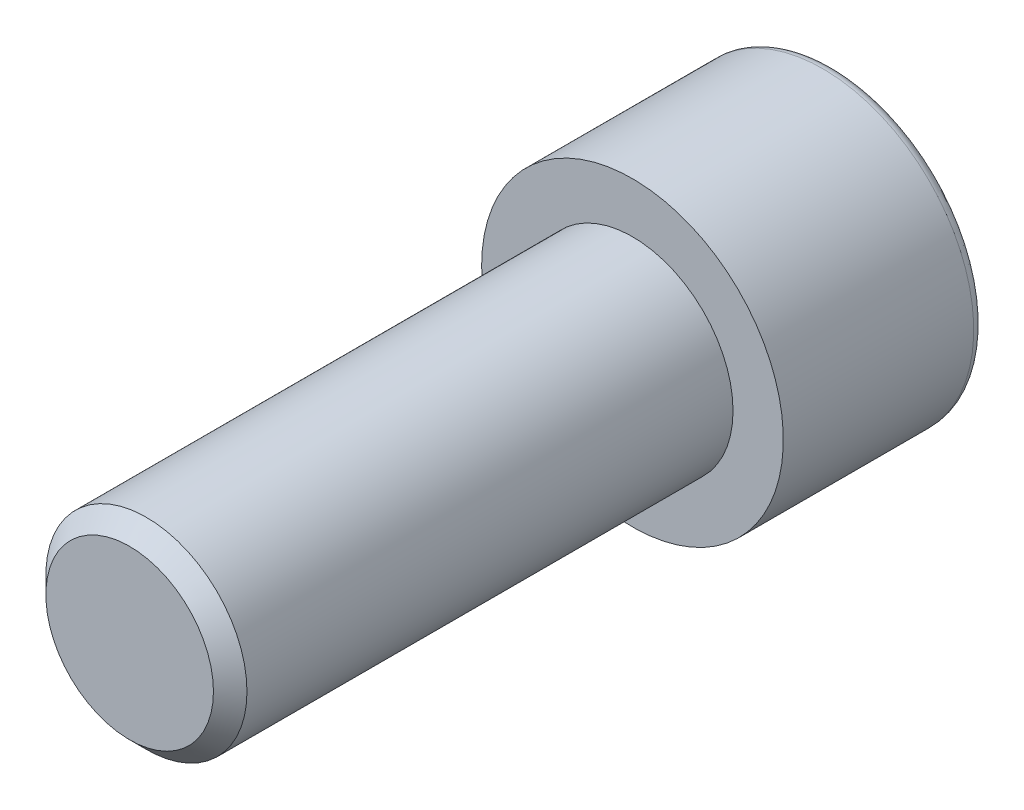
ISO-10303-21;
HEADER;
FILE_DESCRIPTION(('STEP AP214'),'2;1');
FILE_NAME('part.step','',(''),(''),'','','');
FILE_SCHEMA(('AUTOMOTIVE_DESIGN { 1 0 10303 214 1 1 1 1 }'));
ENDSEC;
DATA;
#1=APPLICATION_CONTEXT('core data for automotive mechanical design processes');
#2=APPLICATION_PROTOCOL_DEFINITION('international standard','automotive_design',2000,#1);
#3=PRODUCT_CONTEXT('',#1,'mechanical');
#4=PRODUCT('Part','Part','',(#3));
#5=PRODUCT_RELATED_PRODUCT_CATEGORY('part','',(#4));
#6=PRODUCT_DEFINITION_FORMATION('','',#4);
#7=PRODUCT_DEFINITION_CONTEXT('part definition',#1,'design');
#8=PRODUCT_DEFINITION('design','',#6,#7);
#9=PRODUCT_DEFINITION_SHAPE('','',#8);
#10=(LENGTH_UNIT() NAMED_UNIT(*) SI_UNIT(.MILLI.,.METRE.));
#11=(NAMED_UNIT(*) PLANE_ANGLE_UNIT() SI_UNIT($,.RADIAN.));
#12=(NAMED_UNIT(*) SI_UNIT($,.STERADIAN.) SOLID_ANGLE_UNIT());
#13=UNCERTAINTY_MEASURE_WITH_UNIT(LENGTH_MEASURE(1.E-05),#10,'distance_accuracy_value','');
#14=(GEOMETRIC_REPRESENTATION_CONTEXT(3) GLOBAL_UNCERTAINTY_ASSIGNED_CONTEXT((#13)) GLOBAL_UNIT_ASSIGNED_CONTEXT((#10,
#11,#12)) REPRESENTATION_CONTEXT('',''));
#15=CARTESIAN_POINT('',(0.,0.,0.));
#16=DIRECTION('',(0.,0.,1.));
#17=DIRECTION('',(1.,0.,0.));
#18=AXIS2_PLACEMENT_3D('',#15,#16,#17);
#19=CARTESIAN_POINT('',(0.,0.,-12.));
#20=DIRECTION('',(0.,0.,1.));
#21=DIRECTION('',(1.,0.,0.));
#22=AXIS2_PLACEMENT_3D('',#19,#20,#21);
#23=PLANE('',#22);
#24=CARTESIAN_POINT('',(0.,0.,-12.));
#25=DIRECTION('',(0.,0.,-1.));
#26=DIRECTION('',(-1.,0.,0.));
#27=AXIS2_PLACEMENT_3D('',#24,#25,#26);
#28=CIRCLE('',#27,8.36);
#29=CARTESIAN_POINT('',(-8.35999999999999,0.,-12.));
#30=VERTEX_POINT('',#29);
#31=EDGE_CURVE('E150',#30,#30,#28,.T.);
#32=ORIENTED_EDGE('',*,*,#31,.T.);
#33=EDGE_LOOP('',(#32));
#34=FACE_BOUND('',#33,.T.);
#35=DIRECTION('',(-0.86602540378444,0.499999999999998,0.));
#36=VECTOR('',#35,1.);
#37=CARTESIAN_POINT('',(0.,5.77350269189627,-12.));
#38=LINE('',#37,#36);
#39=CARTESIAN_POINT('',(5.00000000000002,2.88675134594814,-12.));
#40=VERTEX_POINT('',#39);
#41=CARTESIAN_POINT('',(0.,5.77350269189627,-12.));
#42=VERTEX_POINT('',#41);
#43=EDGE_CURVE('E54',#40,#42,#38,.T.);
#44=ORIENTED_EDGE('',*,*,#43,.T.);
#45=DIRECTION('',(-0.866025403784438,-0.500000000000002,0.));
#46=VECTOR('',#45,1.);
#47=CARTESIAN_POINT('',(0.,5.77350269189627,-12.));
#48=LINE('',#47,#46);
#49=CARTESIAN_POINT('',(-4.99999999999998,2.88675134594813,-12.));
#50=VERTEX_POINT('',#49);
#51=EDGE_CURVE('E94',#42,#50,#48,.T.);
#52=ORIENTED_EDGE('',*,*,#51,.T.);
#53=DIRECTION('',(0.,-1.,0.));
#54=VECTOR('',#53,1.);
#55=CARTESIAN_POINT('',(-4.99999999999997,-2.88675134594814,-12.));
#56=LINE('',#55,#54);
#57=CARTESIAN_POINT('',(-4.99999999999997,-2.88675134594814,-12.));
#58=VERTEX_POINT('',#57);
#59=EDGE_CURVE('E102',#50,#58,#56,.T.);
#60=ORIENTED_EDGE('',*,*,#59,.T.);
#61=DIRECTION('',(0.866025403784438,-0.500000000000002,0.));
#62=VECTOR('',#61,1.);
#63=CARTESIAN_POINT('',(0.,-5.77350269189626,-12.));
#64=LINE('',#63,#62);
#65=CARTESIAN_POINT('',(0.,-5.77350269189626,-12.));
#66=VERTEX_POINT('',#65);
#67=EDGE_CURVE('E120',#58,#66,#64,.T.);
#68=ORIENTED_EDGE('',*,*,#67,.T.);
#69=DIRECTION('',(0.86602540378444,0.499999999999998,0.));
#70=VECTOR('',#69,1.);
#71=CARTESIAN_POINT('',(0.,-5.77350269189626,-12.));
#72=LINE('',#71,#70);
#73=CARTESIAN_POINT('',(5.00000000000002,-2.88675134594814,-12.));
#74=VERTEX_POINT('',#73);
#75=EDGE_CURVE('E123',#66,#74,#72,.T.);
#76=ORIENTED_EDGE('',*,*,#75,.T.);
#77=DIRECTION('',(0.,1.,0.));
#78=VECTOR('',#77,1.);
#79=CARTESIAN_POINT('',(5.00000000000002,-2.88675134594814,-12.));
#80=LINE('',#79,#78);
#81=EDGE_CURVE('E113',#74,#40,#80,.T.);
#82=ORIENTED_EDGE('',*,*,#81,.T.);
#83=EDGE_LOOP('',(#44,#52,#60,#68,#76,#82));
#84=FACE_BOUND('',#83,.T.);
#85=ADVANCED_FACE('F40',(#34,#84),#23,.F.);
#86=CARTESIAN_POINT('',(0.,0.,-11.36));
#87=DIRECTION('',(0.,0.,-1.));
#88=DIRECTION('',(-1.,0.,0.));
#89=AXIS2_PLACEMENT_3D('',#86,#87,#88);
#90=TOROIDAL_SURFACE('',#89,8.36,0.639999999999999);
#91=ORIENTED_EDGE('',*,*,#31,.F.);
#92=EDGE_LOOP('',(#91));
#93=FACE_BOUND('',#92,.T.);
#94=CARTESIAN_POINT('',(0.,0.,-11.36));
#95=DIRECTION('',(0.,0.,-1.));
#96=DIRECTION('',(-1.,0.,0.));
#97=AXIS2_PLACEMENT_3D('',#94,#95,#96);
#98=CIRCLE('',#97,9.);
#99=CARTESIAN_POINT('',(-8.99999999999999,0.,-11.36));
#100=VERTEX_POINT('',#99);
#101=EDGE_CURVE('E147',#100,#100,#98,.T.);
#102=ORIENTED_EDGE('',*,*,#101,.T.);
#103=EDGE_LOOP('',(#102));
#104=FACE_BOUND('',#103,.T.);
#105=ADVANCED_FACE('F169',(#93,#104),#90,.T.);
#106=CARTESIAN_POINT('',(0.,0.,0.));
#107=DIRECTION('',(0.,0.,-1.));
#108=DIRECTION('',(-1.,0.,0.));
#109=AXIS2_PLACEMENT_3D('',#106,#107,#108);
#110=CYLINDRICAL_SURFACE('',#109,9.);
#111=ORIENTED_EDGE('',*,*,#101,.F.);
#112=EDGE_LOOP('',(#111));
#113=FACE_BOUND('',#112,.T.);
#114=CARTESIAN_POINT('',(0.,0.,0.));
#115=DIRECTION('',(0.,0.,-1.));
#116=DIRECTION('',(-1.,0.,0.));
#117=AXIS2_PLACEMENT_3D('',#114,#115,#116);
#118=CIRCLE('',#117,9.);
#119=CARTESIAN_POINT('',(-8.99999999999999,0.,0.));
#120=VERTEX_POINT('',#119);
#121=EDGE_CURVE('E108',#120,#120,#118,.T.);
#122=ORIENTED_EDGE('',*,*,#121,.T.);
#123=EDGE_LOOP('',(#122));
#124=FACE_BOUND('',#123,.T.);
#125=ADVANCED_FACE('F174',(#113,#124),#110,.T.);
#126=CARTESIAN_POINT('',(0.,0.,0.));
#127=DIRECTION('',(0.,0.,-1.));
#128=DIRECTION('',(-1.,0.,0.));
#129=AXIS2_PLACEMENT_3D('',#126,#127,#128);
#130=PLANE('',#129);
#131=CARTESIAN_POINT('',(0.,0.,0.));
#132=DIRECTION('',(0.,0.,1.));
#133=DIRECTION('',(1.,0.,0.));
#134=AXIS2_PLACEMENT_3D('',#131,#132,#133);
#135=CIRCLE('',#134,6.);
#136=CARTESIAN_POINT('',(6.00000000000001,0.,0.));
#137=VERTEX_POINT('',#136);
#138=EDGE_CURVE('E114',#137,#137,#135,.T.);
#139=ORIENTED_EDGE('',*,*,#138,.F.);
#140=EDGE_LOOP('',(#139));
#141=FACE_BOUND('',#140,.T.);
#142=ORIENTED_EDGE('',*,*,#121,.F.);
#143=EDGE_LOOP('',(#142));
#144=FACE_BOUND('',#143,.T.);
#145=ADVANCED_FACE('F182',(#141,#144),#130,.F.);
#146=CARTESIAN_POINT('',(0.,5.77350269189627,-6.00000000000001));
#147=DIRECTION('',(-0.499999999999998,-0.86602540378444,0.));
#148=DIRECTION('',(0.86602540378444,-0.499999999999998,0.));
#149=AXIS2_PLACEMENT_3D('',#146,#147,#148);
#150=PLANE('',#149);
#151=ORIENTED_EDGE('',*,*,#43,.F.);
#152=DIRECTION('',(0.,0.,-1.));
#153=VECTOR('',#152,1.);
#154=CARTESIAN_POINT('',(5.00000000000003,2.88675134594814,-6.00000000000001));
#155=LINE('',#154,#153);
#156=CARTESIAN_POINT('',(5.00000000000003,2.88675134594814,-6.00000000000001));
#157=VERTEX_POINT('',#156);
#158=EDGE_CURVE('E136',#157,#40,#155,.T.);
#159=ORIENTED_EDGE('',*,*,#158,.F.);
#160=DIRECTION('',(-0.86602540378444,0.499999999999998,0.));
#161=VECTOR('',#160,1.);
#162=CARTESIAN_POINT('',(0.,5.77350269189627,-6.00000000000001));
#163=LINE('',#162,#161);
#164=CARTESIAN_POINT('',(0.,5.77350269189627,-6.00000000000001));
#165=VERTEX_POINT('',#164);
#166=EDGE_CURVE('E107',#157,#165,#163,.T.);
#167=ORIENTED_EDGE('',*,*,#166,.T.);
#168=DIRECTION('',(0.,0.,-1.));
#169=VECTOR('',#168,1.);
#170=CARTESIAN_POINT('',(0.,5.77350269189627,-6.00000000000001));
#171=LINE('',#170,#169);
#172=EDGE_CURVE('E96',#165,#42,#171,.T.);
#173=ORIENTED_EDGE('',*,*,#172,.T.);
#174=EDGE_LOOP('',(#151,#159,#167,#173));
#175=FACE_BOUND('',#174,.T.);
#176=ADVANCED_FACE('F105',(#175),#150,.T.);
#177=CARTESIAN_POINT('',(0.,5.77350269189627,-6.00000000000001));
#178=DIRECTION('',(0.500000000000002,-0.866025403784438,0.));
#179=DIRECTION('',(0.866025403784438,0.500000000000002,0.));
#180=AXIS2_PLACEMENT_3D('',#177,#178,#179);
#181=PLANE('',#180);
#182=ORIENTED_EDGE('',*,*,#51,.F.);
#183=ORIENTED_EDGE('',*,*,#172,.F.);
#184=DIRECTION('',(-0.866025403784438,-0.500000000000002,0.));
#185=VECTOR('',#184,1.);
#186=CARTESIAN_POINT('',(0.,5.77350269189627,-6.00000000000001));
#187=LINE('',#186,#185);
#188=CARTESIAN_POINT('',(-4.99999999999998,2.88675134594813,-6.00000000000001));
#189=VERTEX_POINT('',#188);
#190=EDGE_CURVE('E127',#165,#189,#187,.T.);
#191=ORIENTED_EDGE('',*,*,#190,.T.);
#192=DIRECTION('',(0.,0.,-1.));
#193=VECTOR('',#192,1.);
#194=CARTESIAN_POINT('',(-4.99999999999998,2.88675134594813,-6.00000000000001));
#195=LINE('',#194,#193);
#196=EDGE_CURVE('E98',#189,#50,#195,.T.);
#197=ORIENTED_EDGE('',*,*,#196,.T.);
#198=EDGE_LOOP('',(#182,#183,#191,#197));
#199=FACE_BOUND('',#198,.T.);
#200=ADVANCED_FACE('F95',(#199),#181,.T.);
#201=CARTESIAN_POINT('',(-4.99999999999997,-2.88675134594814,-6.00000000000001));
#202=DIRECTION('',(1.,0.,0.));
#203=DIRECTION('',(0.,0.,-1.));
#204=AXIS2_PLACEMENT_3D('',#201,#202,#203);
#205=PLANE('',#204);
#206=ORIENTED_EDGE('',*,*,#59,.F.);
#207=ORIENTED_EDGE('',*,*,#196,.F.);
#208=DIRECTION('',(0.,-1.,0.));
#209=VECTOR('',#208,1.);
#210=CARTESIAN_POINT('',(-4.99999999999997,-2.88675134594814,-6.00000000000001));
#211=LINE('',#210,#209);
#212=CARTESIAN_POINT('',(-4.99999999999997,-2.88675134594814,-6.00000000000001));
#213=VERTEX_POINT('',#212);
#214=EDGE_CURVE('E129',#189,#213,#211,.T.);
#215=ORIENTED_EDGE('',*,*,#214,.T.);
#216=DIRECTION('',(0.,0.,-1.));
#217=VECTOR('',#216,1.);
#218=CARTESIAN_POINT('',(-4.99999999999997,-2.88675134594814,-6.00000000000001));
#219=LINE('',#218,#217);
#220=EDGE_CURVE('E142',#213,#58,#219,.T.);
#221=ORIENTED_EDGE('',*,*,#220,.T.);
#222=EDGE_LOOP('',(#206,#207,#215,#221));
#223=FACE_BOUND('',#222,.T.);
#224=ADVANCED_FACE('F197',(#223),#205,.T.);
#225=CARTESIAN_POINT('',(0.,-5.77350269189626,-6.00000000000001));
#226=DIRECTION('',(0.500000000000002,0.866025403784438,0.));
#227=DIRECTION('',(-0.866025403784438,0.500000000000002,0.));
#228=AXIS2_PLACEMENT_3D('',#225,#226,#227);
#229=PLANE('',#228);
#230=ORIENTED_EDGE('',*,*,#67,.F.);
#231=ORIENTED_EDGE('',*,*,#220,.F.);
#232=DIRECTION('',(0.866025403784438,-0.500000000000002,0.));
#233=VECTOR('',#232,1.);
#234=CARTESIAN_POINT('',(0.,-5.77350269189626,-6.00000000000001));
#235=LINE('',#234,#233);
#236=CARTESIAN_POINT('',(0.,-5.77350269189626,-6.00000000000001));
#237=VERTEX_POINT('',#236);
#238=EDGE_CURVE('E131',#213,#237,#235,.T.);
#239=ORIENTED_EDGE('',*,*,#238,.T.);
#240=DIRECTION('',(0.,0.,-1.));
#241=VECTOR('',#240,1.);
#242=CARTESIAN_POINT('',(0.,-5.77350269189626,-6.00000000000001));
#243=LINE('',#242,#241);
#244=EDGE_CURVE('E140',#237,#66,#243,.T.);
#245=ORIENTED_EDGE('',*,*,#244,.T.);
#246=EDGE_LOOP('',(#230,#231,#239,#245));
#247=FACE_BOUND('',#246,.T.);
#248=ADVANCED_FACE('F200',(#247),#229,.T.);
#249=CARTESIAN_POINT('',(0.,-5.77350269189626,-6.00000000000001));
#250=DIRECTION('',(-0.499999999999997,0.86602540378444,0.));
#251=DIRECTION('',(-0.86602540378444,-0.499999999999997,0.));
#252=AXIS2_PLACEMENT_3D('',#249,#250,#251);
#253=PLANE('',#252);
#254=ORIENTED_EDGE('',*,*,#75,.F.);
#255=ORIENTED_EDGE('',*,*,#244,.F.);
#256=DIRECTION('',(0.86602540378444,0.499999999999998,0.));
#257=VECTOR('',#256,1.);
#258=CARTESIAN_POINT('',(0.,-5.77350269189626,-6.00000000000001));
#259=LINE('',#258,#257);
#260=CARTESIAN_POINT('',(5.00000000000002,-2.88675134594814,-6.00000000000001));
#261=VERTEX_POINT('',#260);
#262=EDGE_CURVE('E133',#237,#261,#259,.T.);
#263=ORIENTED_EDGE('',*,*,#262,.T.);
#264=DIRECTION('',(0.,0.,-1.));
#265=VECTOR('',#264,1.);
#266=CARTESIAN_POINT('',(5.00000000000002,-2.88675134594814,-6.00000000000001));
#267=LINE('',#266,#265);
#268=EDGE_CURVE('E138',#261,#74,#267,.T.);
#269=ORIENTED_EDGE('',*,*,#268,.T.);
#270=EDGE_LOOP('',(#254,#255,#263,#269));
#271=FACE_BOUND('',#270,.T.);
#272=ADVANCED_FACE('F204',(#271),#253,.T.);
#273=CARTESIAN_POINT('',(5.00000000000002,-2.88675134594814,-6.00000000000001));
#274=DIRECTION('',(-1.,0.,0.));
#275=DIRECTION('',(0.,0.,1.));
#276=AXIS2_PLACEMENT_3D('',#273,#274,#275);
#277=PLANE('',#276);
#278=ORIENTED_EDGE('',*,*,#81,.F.);
#279=ORIENTED_EDGE('',*,*,#268,.F.);
#280=DIRECTION('',(0.,1.,0.));
#281=VECTOR('',#280,1.);
#282=CARTESIAN_POINT('',(5.00000000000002,-2.88675134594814,-6.00000000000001));
#283=LINE('',#282,#281);
#284=EDGE_CURVE('E61',#261,#157,#283,.T.);
#285=ORIENTED_EDGE('',*,*,#284,.T.);
#286=ORIENTED_EDGE('',*,*,#158,.T.);
#287=EDGE_LOOP('',(#278,#279,#285,#286));
#288=FACE_BOUND('',#287,.T.);
#289=ADVANCED_FACE('F208',(#288),#277,.T.);
#290=CARTESIAN_POINT('',(5.00000000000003,2.88675134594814,-6.00000000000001));
#291=DIRECTION('',(0.,0.,1.));
#292=DIRECTION('',(1.,0.,0.));
#293=AXIS2_PLACEMENT_3D('',#290,#291,#292);
#294=PLANE('',#293);
#295=ORIENTED_EDGE('',*,*,#166,.F.);
#296=ORIENTED_EDGE('',*,*,#284,.F.);
#297=ORIENTED_EDGE('',*,*,#262,.F.);
#298=ORIENTED_EDGE('',*,*,#238,.F.);
#299=ORIENTED_EDGE('',*,*,#214,.F.);
#300=ORIENTED_EDGE('',*,*,#190,.F.);
#301=EDGE_LOOP('',(#295,#296,#297,#298,#299,#300));
#302=FACE_BOUND('',#301,.T.);
#303=ADVANCED_FACE('F212',(#302),#294,.F.);
#304=CARTESIAN_POINT('',(0.,0.,30.));
#305=DIRECTION('',(0.,0.,1.));
#306=DIRECTION('',(1.,0.,0.));
#307=AXIS2_PLACEMENT_3D('',#304,#305,#306);
#308=PLANE('',#307);
#309=CARTESIAN_POINT('',(0.,0.,30.));
#310=DIRECTION('',(0.,0.,1.));
#311=DIRECTION('',(1.,0.,0.));
#312=AXIS2_PLACEMENT_3D('',#309,#310,#311);
#313=CIRCLE('',#312,5.);
#314=CARTESIAN_POINT('',(5.00000000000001,0.,30.));
#315=VERTEX_POINT('',#314);
#316=EDGE_CURVE('E47',#315,#315,#313,.T.);
#317=ORIENTED_EDGE('',*,*,#316,.T.);
#318=EDGE_LOOP('',(#317));
#319=FACE_BOUND('',#318,.T.);
#320=ADVANCED_FACE('F155',(#319),#308,.T.);
#321=CARTESIAN_POINT('',(0.,0.,0.));
#322=DIRECTION('',(0.,0.,1.));
#323=DIRECTION('',(1.,0.,0.));
#324=AXIS2_PLACEMENT_3D('',#321,#322,#323);
#325=CYLINDRICAL_SURFACE('',#324,6.);
#326=CARTESIAN_POINT('',(0.,0.,29.));
#327=DIRECTION('',(0.,0.,1.));
#328=DIRECTION('',(1.,0.,0.));
#329=AXIS2_PLACEMENT_3D('',#326,#327,#328);
#330=CIRCLE('',#329,6.);
#331=CARTESIAN_POINT('',(6.00000000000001,0.,29.));
#332=VERTEX_POINT('',#331);
#333=EDGE_CURVE('E11',#332,#332,#330,.F.);
#334=ORIENTED_EDGE('',*,*,#333,.T.);
#335=EDGE_LOOP('',(#334));
#336=FACE_BOUND('',#335,.T.);
#337=ORIENTED_EDGE('',*,*,#138,.T.);
#338=EDGE_LOOP('',(#337));
#339=FACE_BOUND('',#338,.T.);
#340=ADVANCED_FACE('F159',(#336,#339),#325,.T.);
#341=CARTESIAN_POINT('',(0.,0.,30.));
#342=DIRECTION('',(0.,0.,-1.));
#343=DIRECTION('',(-1.,0.,0.));
#344=AXIS2_PLACEMENT_3D('',#341,#342,#343);
#345=CONICAL_SURFACE('',#344,5.,0.785398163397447);
#346=ORIENTED_EDGE('',*,*,#333,.F.);
#347=EDGE_LOOP('',(#346));
#348=FACE_BOUND('',#347,.T.);
#349=ORIENTED_EDGE('',*,*,#316,.F.);
#350=EDGE_LOOP('',(#349));
#351=FACE_BOUND('',#350,.T.);
#352=ADVANCED_FACE('F157',(#348,#351),#345,.T.);
#353=CLOSED_SHELL('',(#85,#105,#125,#145,#176,#200,#224,#248,#272,#289,#303,#320,#340,#352));
#354=MANIFOLD_SOLID_BREP('B2',#353);
#355=ADVANCED_BREP_SHAPE_REPRESENTATION('',(#18,#354),#14);
#356=SHAPE_DEFINITION_REPRESENTATION(#9,#355);
ENDSEC;
END-ISO-10303-21;
